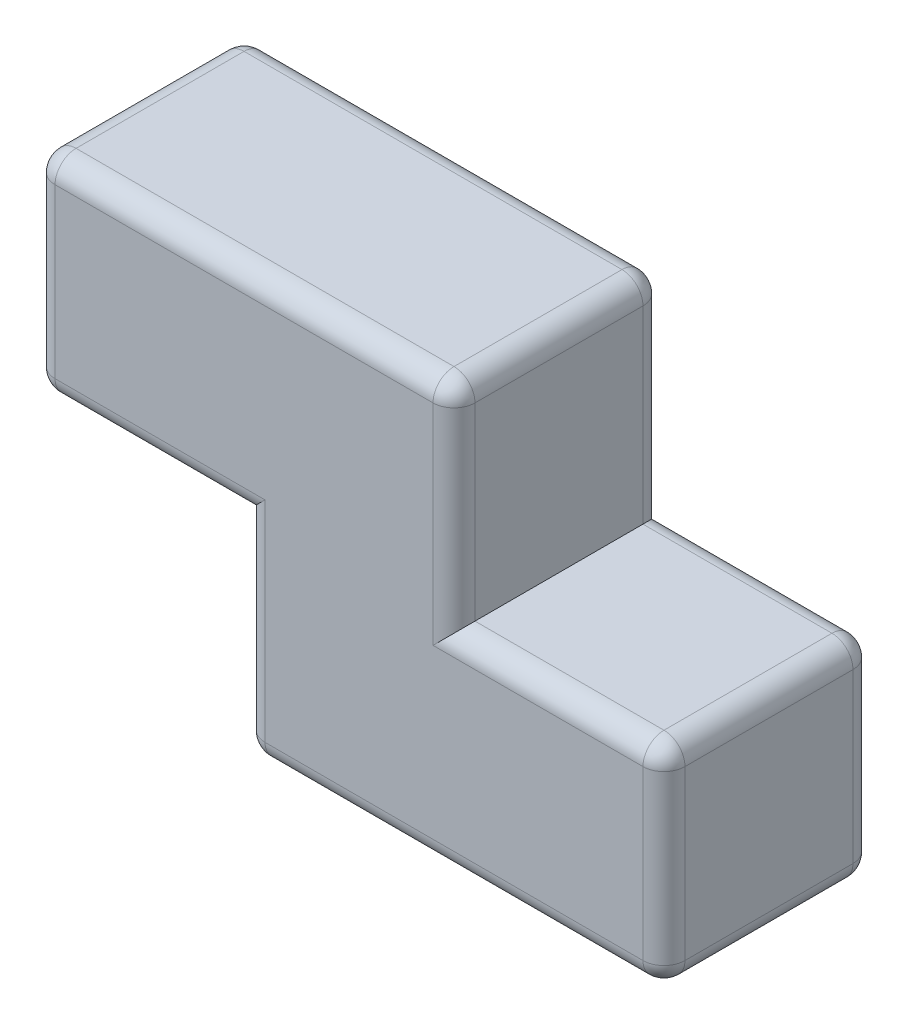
from build123d import *

# Parameters (mm, degrees)
BOSS_EXTRUDE1_DEPTH = 100
FILLET3_R           = 10


with BuildPart() as part:
    # Sketch1 → Boss-Extrude1 (new body)
    with BuildSketch(Plane.XY):
        Polygon((-326.4, 114.740311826), (-126.4, 114.740311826), (-126.4, 14.740311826), (-26.4, 14.740311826), (-26.4, -85.259688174), (-126.4, -85.259688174), (-226.4, -85.259688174), (-226.4, 14.740311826), (-326.4, 14.740311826), align=None)
    extrude(amount=BOSS_EXTRUDE1_DEPTH)

    # Fillet3
    fillet3_edges = [part.edges().sort_by_distance(p)[0] for p in [
        (-226.4, -35.259688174, 100),
        (-126.4, -85.259688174, 0),
        (-226.4, -35.259688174, 0),
        (-276.4, 14.740311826, 0),
        (-326.4, 64.740311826, 0),
        (-126.4, -85.259688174, 100),
        (-326.4, 114.740311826, 50),
        (-126.4, 114.740311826, 50),
        (-26.4, 14.740311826, 50),
        (-26.4, -85.259688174, 50),
        (-226.4, -85.259688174, 50),
        (-326.4, 14.740311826, 50),
        (-26.4, -35.259688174, 100),
        (-76.4, 14.740311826, 100),
        (-126.4, 64.740311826, 100),
        (-226.4, 114.740311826, 100),
        (-326.4, 64.740311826, 100),
        (-276.4, 14.740311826, 100),
        (-226.4, 114.740311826, 0),
        (-126.4, 64.740311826, 0),
        (-76.4, 14.740311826, 0),
        (-26.4, -35.259688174, 0),
    ]]
    fillet(fillet3_edges, radius=FILLET3_R)


solid = part.part
